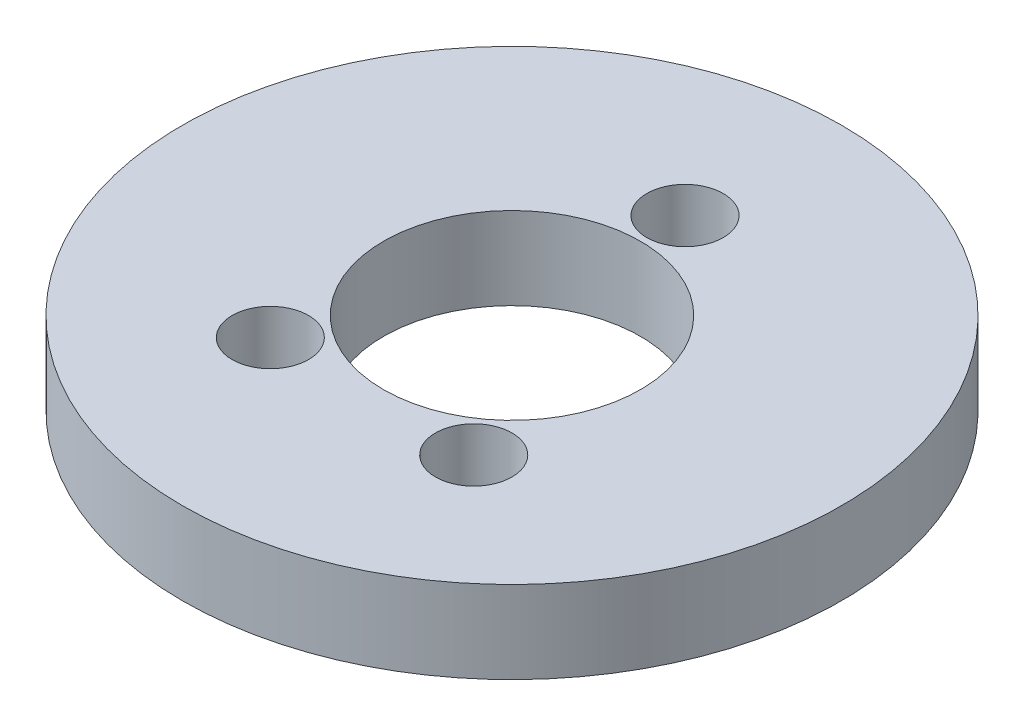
ISO-10303-21;
HEADER;
FILE_DESCRIPTION(('STEP AP214'),'2;1');
FILE_NAME('part.step','',(''),(''),'','','');
FILE_SCHEMA(('AUTOMOTIVE_DESIGN { 1 0 10303 214 1 1 1 1 }'));
ENDSEC;
DATA;
#1=APPLICATION_CONTEXT('core data for automotive mechanical design processes');
#2=APPLICATION_PROTOCOL_DEFINITION('international standard','automotive_design',2000,#1);
#3=PRODUCT_CONTEXT('',#1,'mechanical');
#4=PRODUCT('Part','Part','',(#3));
#5=PRODUCT_RELATED_PRODUCT_CATEGORY('part','',(#4));
#6=PRODUCT_DEFINITION_FORMATION('','',#4);
#7=PRODUCT_DEFINITION_CONTEXT('part definition',#1,'design');
#8=PRODUCT_DEFINITION('design','',#6,#7);
#9=PRODUCT_DEFINITION_SHAPE('','',#8);
#10=(LENGTH_UNIT() NAMED_UNIT(*) SI_UNIT(.MILLI.,.METRE.));
#11=(NAMED_UNIT(*) PLANE_ANGLE_UNIT() SI_UNIT($,.RADIAN.));
#12=(NAMED_UNIT(*) SI_UNIT($,.STERADIAN.) SOLID_ANGLE_UNIT());
#13=UNCERTAINTY_MEASURE_WITH_UNIT(LENGTH_MEASURE(1.E-05),#10,'distance_accuracy_value','');
#14=(GEOMETRIC_REPRESENTATION_CONTEXT(3) GLOBAL_UNCERTAINTY_ASSIGNED_CONTEXT((#13)) GLOBAL_UNIT_ASSIGNED_CONTEXT((#10,
#11,#12)) REPRESENTATION_CONTEXT('',''));
#15=CARTESIAN_POINT('',(0.,0.,0.));
#16=DIRECTION('',(0.,0.,1.));
#17=DIRECTION('',(1.,0.,0.));
#18=AXIS2_PLACEMENT_3D('',#15,#16,#17);
#19=CARTESIAN_POINT('',(0.,3.175,0.));
#20=DIRECTION('',(0.,1.,0.));
#21=DIRECTION('',(0.,0.,1.));
#22=AXIS2_PLACEMENT_3D('',#19,#20,#21);
#23=PLANE('',#22);
#24=CARTESIAN_POINT('',(3.91905816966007,3.175,5.39412080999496));
#25=DIRECTION('',(0.,1.,0.));
#26=DIRECTION('',(0.,0.,1.));
#27=AXIS2_PLACEMENT_3D('',#24,#25,#26);
#28=CIRCLE('',#27,1.4732);
#29=CARTESIAN_POINT('',(3.91905816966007,3.175,6.86732080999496));
#30=VERTEX_POINT('',#29);
#31=EDGE_CURVE('E55',#30,#30,#28,.T.);
#32=ORIENTED_EDGE('',*,*,#31,.F.);
#33=EDGE_LOOP('',(#32));
#34=FACE_BOUND('',#33,.T.);
#35=CARTESIAN_POINT('',(0.,3.175,0.));
#36=DIRECTION('',(0.,1.,0.));
#37=DIRECTION('',(0.,0.,1.));
#38=AXIS2_PLACEMENT_3D('',#35,#36,#37);
#39=CIRCLE('',#38,4.953);
#40=CARTESIAN_POINT('',(0.,3.175,4.953));
#41=VERTEX_POINT('',#40);
#42=EDGE_CURVE('E44',#41,#41,#39,.T.);
#43=ORIENTED_EDGE('',*,*,#42,.F.);
#44=EDGE_LOOP('',(#43));
#45=FACE_BOUND('',#44,.T.);
#46=CARTESIAN_POINT('',(0.,3.175,0.));
#47=DIRECTION('',(0.,1.,0.));
#48=DIRECTION('',(0.,0.,1.));
#49=AXIS2_PLACEMENT_3D('',#46,#47,#48);
#50=CIRCLE('',#49,12.7);
#51=CARTESIAN_POINT('',(0.,3.175,12.7));
#52=VERTEX_POINT('',#51);
#53=EDGE_CURVE('E10',#52,#52,#50,.T.);
#54=ORIENTED_EDGE('',*,*,#53,.T.);
#55=EDGE_LOOP('',(#54));
#56=FACE_BOUND('',#55,.T.);
#57=CARTESIAN_POINT('',(0.,3.175,-6.6675));
#58=DIRECTION('',(0.,1.,0.));
#59=DIRECTION('',(0.,0.,1.));
#60=AXIS2_PLACEMENT_3D('',#57,#58,#59);
#61=CIRCLE('',#60,1.4732);
#62=CARTESIAN_POINT('',(0.,3.175,-5.1943));
#63=VERTEX_POINT('',#62);
#64=EDGE_CURVE('E49',#63,#63,#61,.T.);
#65=ORIENTED_EDGE('',*,*,#64,.F.);
#66=EDGE_LOOP('',(#65));
#67=FACE_BOUND('',#66,.T.);
#68=CARTESIAN_POINT('',(-3.91905816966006,3.175,5.39412080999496));
#69=DIRECTION('',(0.,1.,0.));
#70=DIRECTION('',(0.,0.,1.));
#71=AXIS2_PLACEMENT_3D('',#68,#69,#70);
#72=CIRCLE('',#71,1.4732);
#73=CARTESIAN_POINT('',(-3.91905816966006,3.175,6.86732080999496));
#74=VERTEX_POINT('',#73);
#75=EDGE_CURVE('E61',#74,#74,#72,.T.);
#76=ORIENTED_EDGE('',*,*,#75,.F.);
#77=EDGE_LOOP('',(#76));
#78=FACE_BOUND('',#77,.T.);
#79=ADVANCED_FACE('F33',(#34,#45,#56,#67,#78),#23,.T.);
#80=CARTESIAN_POINT('',(0.,0.,0.));
#81=DIRECTION('',(0.,1.,0.));
#82=DIRECTION('',(0.,0.,1.));
#83=AXIS2_PLACEMENT_3D('',#80,#81,#82);
#84=PLANE('',#83);
#85=CARTESIAN_POINT('',(0.,0.,0.));
#86=DIRECTION('',(0.,1.,0.));
#87=DIRECTION('',(0.,0.,1.));
#88=AXIS2_PLACEMENT_3D('',#85,#86,#87);
#89=CIRCLE('',#88,12.7);
#90=CARTESIAN_POINT('',(0.,0.,12.7));
#91=VERTEX_POINT('',#90);
#92=EDGE_CURVE('E37',#91,#91,#89,.T.);
#93=ORIENTED_EDGE('',*,*,#92,.F.);
#94=EDGE_LOOP('',(#93));
#95=FACE_BOUND('',#94,.T.);
#96=CARTESIAN_POINT('',(0.,0.,0.));
#97=DIRECTION('',(0.,1.,0.));
#98=DIRECTION('',(0.,0.,1.));
#99=AXIS2_PLACEMENT_3D('',#96,#97,#98);
#100=CIRCLE('',#99,4.953);
#101=CARTESIAN_POINT('',(0.,0.,4.953));
#102=VERTEX_POINT('',#101);
#103=EDGE_CURVE('E46',#102,#102,#100,.T.);
#104=ORIENTED_EDGE('',*,*,#103,.T.);
#105=EDGE_LOOP('',(#104));
#106=FACE_BOUND('',#105,.T.);
#107=CARTESIAN_POINT('',(0.,0.,-6.6675));
#108=DIRECTION('',(0.,1.,0.));
#109=DIRECTION('',(0.,0.,1.));
#110=AXIS2_PLACEMENT_3D('',#107,#108,#109);
#111=CIRCLE('',#110,1.4732);
#112=CARTESIAN_POINT('',(0.,0.,-5.1943));
#113=VERTEX_POINT('',#112);
#114=EDGE_CURVE('E52',#113,#113,#111,.T.);
#115=ORIENTED_EDGE('',*,*,#114,.T.);
#116=EDGE_LOOP('',(#115));
#117=FACE_BOUND('',#116,.T.);
#118=CARTESIAN_POINT('',(3.91905816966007,0.,5.39412080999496));
#119=DIRECTION('',(0.,1.,0.));
#120=DIRECTION('',(0.,0.,1.));
#121=AXIS2_PLACEMENT_3D('',#118,#119,#120);
#122=CIRCLE('',#121,1.4732);
#123=CARTESIAN_POINT('',(3.91905816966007,0.,6.86732080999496));
#124=VERTEX_POINT('',#123);
#125=EDGE_CURVE('E58',#124,#124,#122,.T.);
#126=ORIENTED_EDGE('',*,*,#125,.T.);
#127=EDGE_LOOP('',(#126));
#128=FACE_BOUND('',#127,.T.);
#129=CARTESIAN_POINT('',(-3.91905816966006,0.,5.39412080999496));
#130=DIRECTION('',(0.,1.,0.));
#131=DIRECTION('',(0.,0.,1.));
#132=AXIS2_PLACEMENT_3D('',#129,#130,#131);
#133=CIRCLE('',#132,1.4732);
#134=CARTESIAN_POINT('',(-3.91905816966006,0.,6.86732080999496));
#135=VERTEX_POINT('',#134);
#136=EDGE_CURVE('E64',#135,#135,#133,.T.);
#137=ORIENTED_EDGE('',*,*,#136,.T.);
#138=EDGE_LOOP('',(#137));
#139=FACE_BOUND('',#138,.T.);
#140=ADVANCED_FACE('F74',(#95,#106,#117,#128,#139),#84,.F.);
#141=CARTESIAN_POINT('',(0.,3.175,0.));
#142=DIRECTION('',(0.,-1.,0.));
#143=DIRECTION('',(0.,0.,-1.));
#144=AXIS2_PLACEMENT_3D('',#141,#142,#143);
#145=CYLINDRICAL_SURFACE('',#144,12.7);
#146=ORIENTED_EDGE('',*,*,#53,.F.);
#147=EDGE_LOOP('',(#146));
#148=FACE_BOUND('',#147,.T.);
#149=ORIENTED_EDGE('',*,*,#92,.T.);
#150=EDGE_LOOP('',(#149));
#151=FACE_BOUND('',#150,.T.);
#152=ADVANCED_FACE('F35',(#148,#151),#145,.T.);
#153=CARTESIAN_POINT('',(0.,3.175,0.));
#154=DIRECTION('',(0.,-1.,0.));
#155=DIRECTION('',(0.,0.,-1.));
#156=AXIS2_PLACEMENT_3D('',#153,#154,#155);
#157=CYLINDRICAL_SURFACE('',#156,4.953);
#158=ORIENTED_EDGE('',*,*,#42,.T.);
#159=EDGE_LOOP('',(#158));
#160=FACE_BOUND('',#159,.T.);
#161=ORIENTED_EDGE('',*,*,#103,.F.);
#162=EDGE_LOOP('',(#161));
#163=FACE_BOUND('',#162,.T.);
#164=ADVANCED_FACE('F84',(#160,#163),#157,.F.);
#165=CARTESIAN_POINT('',(0.,3.175,-6.6675));
#166=DIRECTION('',(0.,-1.,0.));
#167=DIRECTION('',(0.,0.,-1.));
#168=AXIS2_PLACEMENT_3D('',#165,#166,#167);
#169=CYLINDRICAL_SURFACE('',#168,1.4732);
#170=ORIENTED_EDGE('',*,*,#64,.T.);
#171=EDGE_LOOP('',(#170));
#172=FACE_BOUND('',#171,.T.);
#173=ORIENTED_EDGE('',*,*,#114,.F.);
#174=EDGE_LOOP('',(#173));
#175=FACE_BOUND('',#174,.T.);
#176=ADVANCED_FACE('F87',(#172,#175),#169,.F.);
#177=CARTESIAN_POINT('',(3.91905816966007,3.175,5.39412080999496));
#178=DIRECTION('',(0.,-1.,0.));
#179=DIRECTION('',(0.,0.,-1.));
#180=AXIS2_PLACEMENT_3D('',#177,#178,#179);
#181=CYLINDRICAL_SURFACE('',#180,1.4732);
#182=ORIENTED_EDGE('',*,*,#31,.T.);
#183=EDGE_LOOP('',(#182));
#184=FACE_BOUND('',#183,.T.);
#185=ORIENTED_EDGE('',*,*,#125,.F.);
#186=EDGE_LOOP('',(#185));
#187=FACE_BOUND('',#186,.T.);
#188=ADVANCED_FACE('F91',(#184,#187),#181,.F.);
#189=CARTESIAN_POINT('',(-3.91905816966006,3.175,5.39412080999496));
#190=DIRECTION('',(0.,-1.,0.));
#191=DIRECTION('',(0.,0.,-1.));
#192=AXIS2_PLACEMENT_3D('',#189,#190,#191);
#193=CYLINDRICAL_SURFACE('',#192,1.4732);
#194=ORIENTED_EDGE('',*,*,#75,.T.);
#195=EDGE_LOOP('',(#194));
#196=FACE_BOUND('',#195,.T.);
#197=ORIENTED_EDGE('',*,*,#136,.F.);
#198=EDGE_LOOP('',(#197));
#199=FACE_BOUND('',#198,.T.);
#200=ADVANCED_FACE('F70',(#196,#199),#193,.F.);
#201=CLOSED_SHELL('',(#79,#140,#152,#164,#176,#188,#200));
#202=MANIFOLD_SOLID_BREP('B2',#201);
#203=ADVANCED_BREP_SHAPE_REPRESENTATION('',(#18,#202),#14);
#204=SHAPE_DEFINITION_REPRESENTATION(#9,#203);
ENDSEC;
END-ISO-10303-21;
